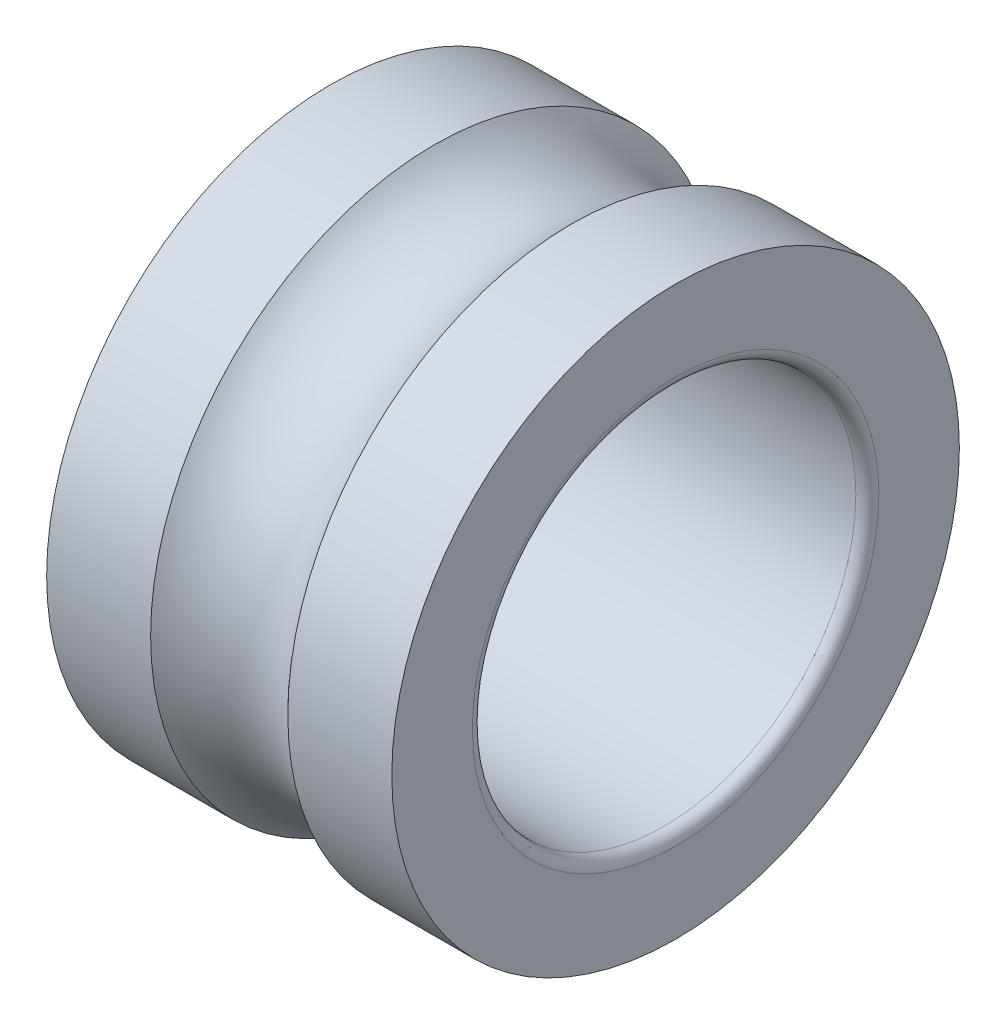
ISO-10303-21;
HEADER;
FILE_DESCRIPTION(('STEP AP214'),'2;1');
FILE_NAME('part.step','',(''),(''),'','','');
FILE_SCHEMA(('AUTOMOTIVE_DESIGN { 1 0 10303 214 1 1 1 1 }'));
ENDSEC;
DATA;
#1=APPLICATION_CONTEXT('core data for automotive mechanical design processes');
#2=APPLICATION_PROTOCOL_DEFINITION('international standard','automotive_design',2000,#1);
#3=PRODUCT_CONTEXT('',#1,'mechanical');
#4=PRODUCT('Part','Part','',(#3));
#5=PRODUCT_RELATED_PRODUCT_CATEGORY('part','',(#4));
#6=PRODUCT_DEFINITION_FORMATION('','',#4);
#7=PRODUCT_DEFINITION_CONTEXT('part definition',#1,'design');
#8=PRODUCT_DEFINITION('design','',#6,#7);
#9=PRODUCT_DEFINITION_SHAPE('','',#8);
#10=(LENGTH_UNIT() NAMED_UNIT(*) SI_UNIT(.MILLI.,.METRE.));
#11=(NAMED_UNIT(*) PLANE_ANGLE_UNIT() SI_UNIT($,.RADIAN.));
#12=(NAMED_UNIT(*) SI_UNIT($,.STERADIAN.) SOLID_ANGLE_UNIT());
#13=UNCERTAINTY_MEASURE_WITH_UNIT(LENGTH_MEASURE(1.E-05),#10,'distance_accuracy_value','');
#14=(GEOMETRIC_REPRESENTATION_CONTEXT(3) GLOBAL_UNCERTAINTY_ASSIGNED_CONTEXT((#13)) GLOBAL_UNIT_ASSIGNED_CONTEXT((#10,
#11,#12)) REPRESENTATION_CONTEXT('',''));
#15=CARTESIAN_POINT('',(0.,0.,0.));
#16=DIRECTION('',(0.,0.,1.));
#17=DIRECTION('',(1.,0.,0.));
#18=AXIS2_PLACEMENT_3D('',#15,#16,#17);
#19=CARTESIAN_POINT('',(0.300000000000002,0.,0.));
#20=DIRECTION('',(-1.,0.,0.));
#21=DIRECTION('',(0.,0.,1.));
#22=AXIS2_PLACEMENT_3D('',#19,#20,#21);
#23=TOROIDAL_SURFACE('',#22,5.3,0.300000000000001);
#24=CARTESIAN_POINT('',(0.300000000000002,0.,0.));
#25=DIRECTION('',(-1.,0.,0.));
#26=DIRECTION('',(0.,0.,1.));
#27=AXIS2_PLACEMENT_3D('',#24,#25,#26);
#28=CIRCLE('',#27,5.);
#29=CARTESIAN_POINT('',(0.300000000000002,0.,5.));
#30=VERTEX_POINT('',#29);
#31=EDGE_CURVE('E10',#30,#30,#28,.T.);
#32=ORIENTED_EDGE('',*,*,#31,.F.);
#33=EDGE_LOOP('',(#32));
#34=FACE_BOUND('',#33,.T.);
#35=CARTESIAN_POINT('',(0.,0.,0.));
#36=DIRECTION('',(-1.,0.,0.));
#37=DIRECTION('',(0.,0.,1.));
#38=AXIS2_PLACEMENT_3D('',#35,#36,#37);
#39=CIRCLE('',#38,5.3);
#40=CARTESIAN_POINT('',(0.,0.,5.3));
#41=VERTEX_POINT('',#40);
#42=EDGE_CURVE('E60',#41,#41,#39,.T.);
#43=ORIENTED_EDGE('',*,*,#42,.T.);
#44=EDGE_LOOP('',(#43));
#45=FACE_BOUND('',#44,.T.);
#46=ADVANCED_FACE('F32',(#34,#45),#23,.T.);
#47=CARTESIAN_POINT('',(0.,0.,0.));
#48=DIRECTION('',(-1.,0.,0.));
#49=DIRECTION('',(0.,0.,1.));
#50=AXIS2_PLACEMENT_3D('',#47,#48,#49);
#51=CYLINDRICAL_SURFACE('',#50,5.);
#52=CARTESIAN_POINT('',(8.7,0.,0.));
#53=DIRECTION('',(-1.,0.,0.));
#54=DIRECTION('',(0.,0.,1.));
#55=AXIS2_PLACEMENT_3D('',#52,#53,#54);
#56=CIRCLE('',#55,5.);
#57=CARTESIAN_POINT('',(8.7,0.,5.));
#58=VERTEX_POINT('',#57);
#59=EDGE_CURVE('E38',#58,#58,#56,.T.);
#60=ORIENTED_EDGE('',*,*,#59,.F.);
#61=EDGE_LOOP('',(#60));
#62=FACE_BOUND('',#61,.T.);
#63=ORIENTED_EDGE('',*,*,#31,.T.);
#64=EDGE_LOOP('',(#63));
#65=FACE_BOUND('',#64,.T.);
#66=ADVANCED_FACE('F97',(#62,#65),#51,.F.);
#67=CARTESIAN_POINT('',(8.7,0.,0.));
#68=DIRECTION('',(-1.,0.,0.));
#69=DIRECTION('',(0.,0.,1.));
#70=AXIS2_PLACEMENT_3D('',#67,#68,#69);
#71=TOROIDAL_SURFACE('',#70,5.3,0.3);
#72=CARTESIAN_POINT('',(9.,0.,0.));
#73=DIRECTION('',(-1.,0.,0.));
#74=DIRECTION('',(0.,0.,1.));
#75=AXIS2_PLACEMENT_3D('',#72,#73,#74);
#76=CIRCLE('',#75,5.3);
#77=CARTESIAN_POINT('',(9.,0.,5.3));
#78=VERTEX_POINT('',#77);
#79=EDGE_CURVE('E42',#78,#78,#76,.T.);
#80=ORIENTED_EDGE('',*,*,#79,.F.);
#81=EDGE_LOOP('',(#80));
#82=FACE_BOUND('',#81,.T.);
#83=ORIENTED_EDGE('',*,*,#59,.T.);
#84=EDGE_LOOP('',(#83));
#85=FACE_BOUND('',#84,.T.);
#86=ADVANCED_FACE('F92',(#82,#85),#71,.T.);
#87=CARTESIAN_POINT('',(9.,0.,-7.4));
#88=DIRECTION('',(-1.,0.,0.));
#89=DIRECTION('',(0.,0.,1.));
#90=AXIS2_PLACEMENT_3D('',#87,#88,#89);
#91=PLANE('',#90);
#92=CARTESIAN_POINT('',(9.,0.,0.));
#93=DIRECTION('',(-1.,0.,0.));
#94=DIRECTION('',(0.,0.,1.));
#95=AXIS2_PLACEMENT_3D('',#92,#93,#94);
#96=CIRCLE('',#95,7.4);
#97=CARTESIAN_POINT('',(9.,0.,7.4));
#98=VERTEX_POINT('',#97);
#99=EDGE_CURVE('E46',#98,#98,#96,.T.);
#100=ORIENTED_EDGE('',*,*,#99,.F.);
#101=EDGE_LOOP('',(#100));
#102=FACE_BOUND('',#101,.T.);
#103=ORIENTED_EDGE('',*,*,#79,.T.);
#104=EDGE_LOOP('',(#103));
#105=FACE_BOUND('',#104,.T.);
#106=ADVANCED_FACE('F86',(#102,#105),#91,.F.);
#107=CARTESIAN_POINT('',(0.,0.,0.));
#108=DIRECTION('',(-1.,0.,0.));
#109=DIRECTION('',(0.,0.,1.));
#110=AXIS2_PLACEMENT_3D('',#107,#108,#109);
#111=CYLINDRICAL_SURFACE('',#110,7.4);
#112=CARTESIAN_POINT('',(6.28885438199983,0.,0.));
#113=DIRECTION('',(-1.,0.,0.));
#114=DIRECTION('',(0.,0.,1.));
#115=AXIS2_PLACEMENT_3D('',#112,#113,#114);
#116=CIRCLE('',#115,7.4);
#117=CARTESIAN_POINT('',(6.28885438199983,0.,7.4));
#118=VERTEX_POINT('',#117);
#119=EDGE_CURVE('E51',#118,#118,#116,.T.);
#120=ORIENTED_EDGE('',*,*,#119,.F.);
#121=EDGE_LOOP('',(#120));
#122=FACE_BOUND('',#121,.T.);
#123=ORIENTED_EDGE('',*,*,#99,.T.);
#124=EDGE_LOOP('',(#123));
#125=FACE_BOUND('',#124,.T.);
#126=ADVANCED_FACE('F80',(#122,#125),#111,.T.);
#127=CARTESIAN_POINT('',(4.5,0.,0.));
#128=DIRECTION('',(-1.,0.,0.));
#129=DIRECTION('',(0.,0.,1.));
#130=AXIS2_PLACEMENT_3D('',#127,#128,#129);
#131=TOROIDAL_SURFACE('',#130,9.,2.4);
#132=CARTESIAN_POINT('',(2.71114561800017,0.,0.));
#133=DIRECTION('',(-1.,0.,0.));
#134=DIRECTION('',(0.,0.,1.));
#135=AXIS2_PLACEMENT_3D('',#132,#133,#134);
#136=CIRCLE('',#135,7.4);
#137=CARTESIAN_POINT('',(2.71114561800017,0.,7.4));
#138=VERTEX_POINT('',#137);
#139=EDGE_CURVE('E54',#138,#138,#136,.T.);
#140=ORIENTED_EDGE('',*,*,#139,.F.);
#141=EDGE_LOOP('',(#140));
#142=FACE_BOUND('',#141,.T.);
#143=ORIENTED_EDGE('',*,*,#119,.T.);
#144=EDGE_LOOP('',(#143));
#145=FACE_BOUND('',#144,.T.);
#146=ADVANCED_FACE('F74',(#142,#145),#131,.F.);
#147=CARTESIAN_POINT('',(0.,0.,0.));
#148=DIRECTION('',(-1.,0.,0.));
#149=DIRECTION('',(0.,0.,1.));
#150=AXIS2_PLACEMENT_3D('',#147,#148,#149);
#151=CYLINDRICAL_SURFACE('',#150,7.4);
#152=CARTESIAN_POINT('',(0.,0.,0.));
#153=DIRECTION('',(-1.,0.,0.));
#154=DIRECTION('',(0.,0.,1.));
#155=AXIS2_PLACEMENT_3D('',#152,#153,#154);
#156=CIRCLE('',#155,7.4);
#157=CARTESIAN_POINT('',(0.,0.,7.4));
#158=VERTEX_POINT('',#157);
#159=EDGE_CURVE('E57',#158,#158,#156,.T.);
#160=ORIENTED_EDGE('',*,*,#159,.F.);
#161=EDGE_LOOP('',(#160));
#162=FACE_BOUND('',#161,.T.);
#163=ORIENTED_EDGE('',*,*,#139,.T.);
#164=EDGE_LOOP('',(#163));
#165=FACE_BOUND('',#164,.T.);
#166=ADVANCED_FACE('F68',(#162,#165),#151,.T.);
#167=CARTESIAN_POINT('',(0.,0.,-7.4));
#168=DIRECTION('',(1.,0.,0.));
#169=DIRECTION('',(0.,0.,-1.));
#170=AXIS2_PLACEMENT_3D('',#167,#168,#169);
#171=PLANE('',#170);
#172=ORIENTED_EDGE('',*,*,#42,.F.);
#173=EDGE_LOOP('',(#172));
#174=FACE_BOUND('',#173,.T.);
#175=ORIENTED_EDGE('',*,*,#159,.T.);
#176=EDGE_LOOP('',(#175));
#177=FACE_BOUND('',#176,.T.);
#178=ADVANCED_FACE('F65',(#174,#177),#171,.F.);
#179=CLOSED_SHELL('',(#46,#66,#86,#106,#126,#146,#166,#178));
#180=MANIFOLD_SOLID_BREP('B2',#179);
#181=ADVANCED_BREP_SHAPE_REPRESENTATION('',(#18,#180),#14);
#182=SHAPE_DEFINITION_REPRESENTATION(#9,#181);
ENDSEC;
END-ISO-10303-21;
